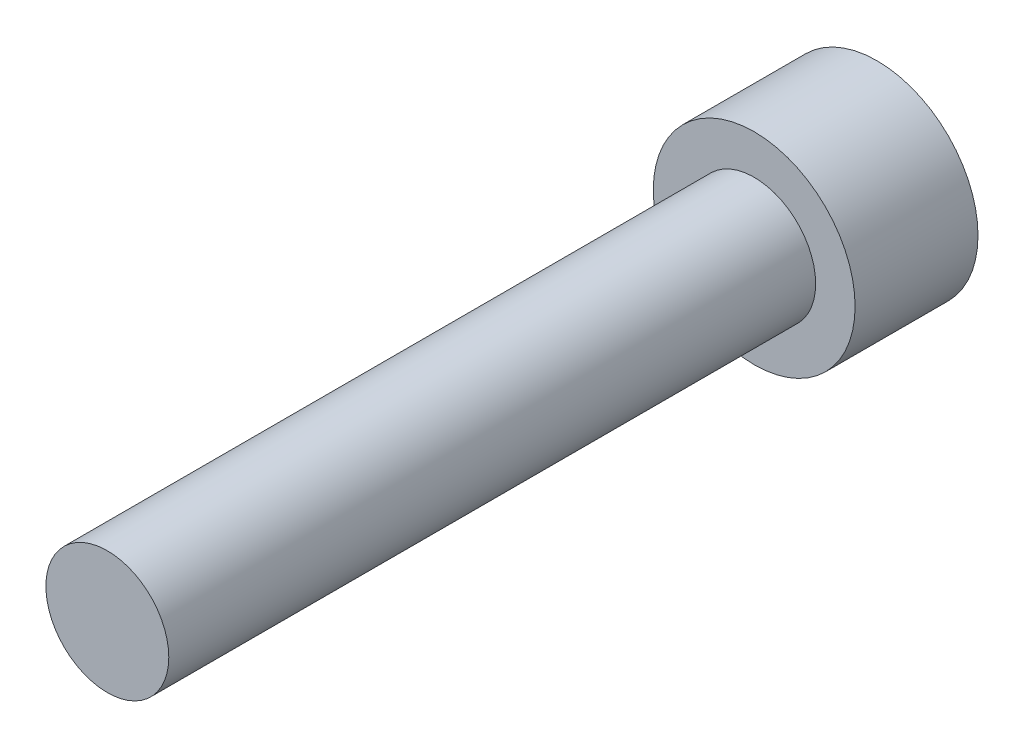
from build123d import *

# Parameters (mm, degrees)
HEX_2_DEPTH = 3.048


with BuildPart() as part:
    # Sketch6 → Revolve1 (revolve)
    with BuildSketch(Plane(origin=(0, 0, 0), x_dir=(0, 0, -1), z_dir=(1, 0, 0)), mode=Mode.PRIVATE) as revolve1_sk:
        Polygon((-25.4, 0), (-25.4, -2.413), (0, -2.413), (0, -3.9624), (4.826, -3.9624), (4.826, 0), align=None)
    revolve(revolve1_sk.sketch.rotate(Axis((0, 0, 25.4), (0, 0, -1)), 270), axis=Axis((0, 0, 25.4), (0, 0, -1)))

    # Sketch7 → HEX 2 (cut)
    with BuildSketch(Plane(origin=(0, 0, -4.826), x_dir=(-1, 0, 0), z_dir=(0, 0, -1))):
        Polygon((-1.9812, 1.143846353), (-1.9812, -1.143846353), (0, -2.287692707), (1.9812, -1.143846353), (1.9812, 1.143846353), (0, 2.287692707), align=None)
    extrude(amount=-HEX_2_DEPTH, mode=Mode.SUBTRACT)


solid = part.part
